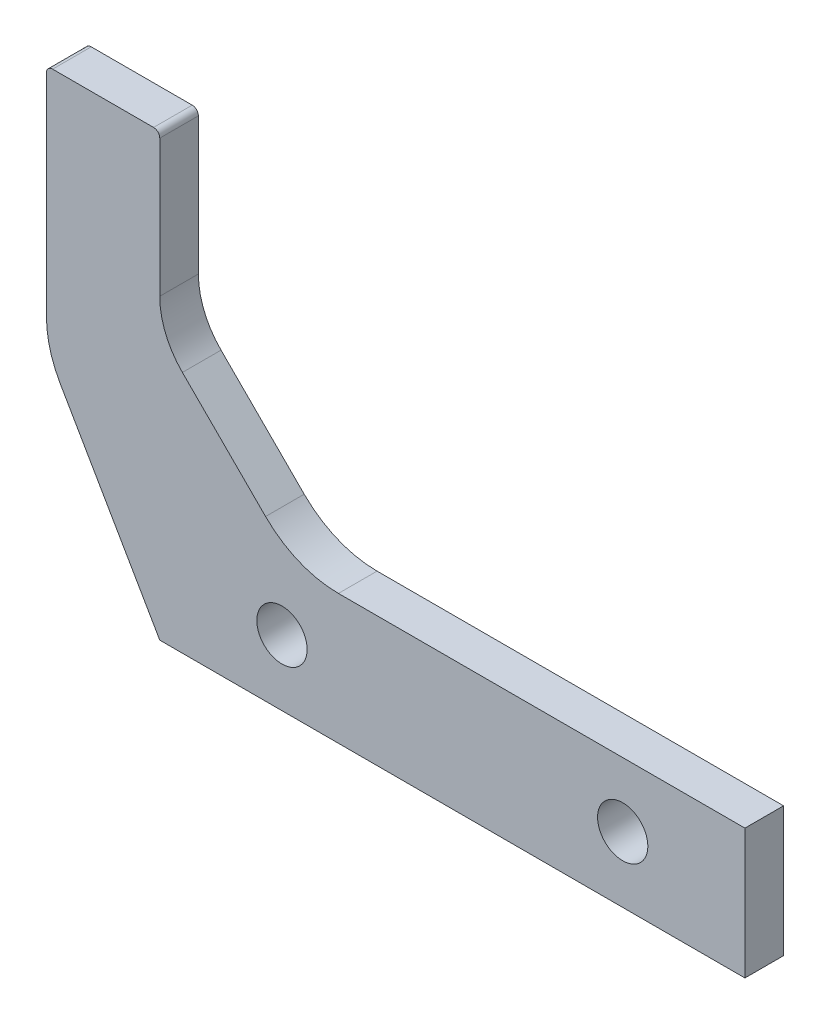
ISO-10303-21;
HEADER;
FILE_DESCRIPTION(('STEP AP214'),'2;1');
FILE_NAME('part.step','',(''),(''),'','','');
FILE_SCHEMA(('AUTOMOTIVE_DESIGN { 1 0 10303 214 1 1 1 1 }'));
ENDSEC;
DATA;
#1=APPLICATION_CONTEXT('core data for automotive mechanical design processes');
#2=APPLICATION_PROTOCOL_DEFINITION('international standard','automotive_design',2000,#1);
#3=PRODUCT_CONTEXT('',#1,'mechanical');
#4=PRODUCT('Part','Part','',(#3));
#5=PRODUCT_RELATED_PRODUCT_CATEGORY('part','',(#4));
#6=PRODUCT_DEFINITION_FORMATION('','',#4);
#7=PRODUCT_DEFINITION_CONTEXT('part definition',#1,'design');
#8=PRODUCT_DEFINITION('design','',#6,#7);
#9=PRODUCT_DEFINITION_SHAPE('','',#8);
#10=(LENGTH_UNIT() NAMED_UNIT(*) SI_UNIT(.MILLI.,.METRE.));
#11=(NAMED_UNIT(*) PLANE_ANGLE_UNIT() SI_UNIT($,.RADIAN.));
#12=(NAMED_UNIT(*) SI_UNIT($,.STERADIAN.) SOLID_ANGLE_UNIT());
#13=UNCERTAINTY_MEASURE_WITH_UNIT(LENGTH_MEASURE(1.E-05),#10,'distance_accuracy_value','');
#14=(GEOMETRIC_REPRESENTATION_CONTEXT(3) GLOBAL_UNCERTAINTY_ASSIGNED_CONTEXT((#13)) GLOBAL_UNIT_ASSIGNED_CONTEXT((#10,
#11,#12)) REPRESENTATION_CONTEXT('',''));
#15=CARTESIAN_POINT('',(0.,0.,0.));
#16=DIRECTION('',(0.,0.,1.));
#17=DIRECTION('',(1.,0.,0.));
#18=AXIS2_PLACEMENT_3D('',#15,#16,#17);
#19=CARTESIAN_POINT('',(-6.985,0.,1.190625));
#20=DIRECTION('',(1.,0.,0.));
#21=DIRECTION('',(0.,1.,0.));
#22=AXIS2_PLACEMENT_3D('',#19,#20,#21);
#23=PLANE('',#22);
#24=DIRECTION('',(0.,-1.,0.));
#25=VECTOR('',#24,1.);
#26=CARTESIAN_POINT('',(-6.985,0.,-1.19062500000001));
#27=LINE('',#26,#25);
#28=CARTESIAN_POINT('',(-6.985,-0.380999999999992,-1.19062500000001));
#29=VERTEX_POINT('',#28);
#30=CARTESIAN_POINT('',(-6.985,-13.3781477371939,-1.19062500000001));
#31=VERTEX_POINT('',#30);
#32=EDGE_CURVE('E134',#29,#31,#27,.T.);
#33=ORIENTED_EDGE('',*,*,#32,.T.);
#34=DIRECTION('',(0.,0.,-1.));
#35=VECTOR('',#34,1.);
#36=CARTESIAN_POINT('',(-6.985,-13.3781477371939,1.190625));
#37=LINE('',#36,#35);
#38=CARTESIAN_POINT('',(-6.985,-13.3781477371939,1.190625));
#39=VERTEX_POINT('',#38);
#40=EDGE_CURVE('E216',#31,#39,#37,.F.);
#41=ORIENTED_EDGE('',*,*,#40,.T.);
#42=DIRECTION('',(0.,-1.,0.));
#43=VECTOR('',#42,1.);
#44=CARTESIAN_POINT('',(-6.985,0.,1.190625));
#45=LINE('',#44,#43);
#46=CARTESIAN_POINT('',(-6.985,-0.380999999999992,1.190625));
#47=VERTEX_POINT('',#46);
#48=EDGE_CURVE('E161',#47,#39,#45,.T.);
#49=ORIENTED_EDGE('',*,*,#48,.F.);
#50=DIRECTION('',(0.,0.,-1.));
#51=VECTOR('',#50,1.);
#52=CARTESIAN_POINT('',(-6.985,-0.380999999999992,1.190625));
#53=LINE('',#52,#51);
#54=EDGE_CURVE('E195',#47,#29,#53,.T.);
#55=ORIENTED_EDGE('',*,*,#54,.T.);
#56=EDGE_LOOP('',(#33,#41,#49,#55));
#57=FACE_BOUND('',#56,.T.);
#58=ADVANCED_FACE('F30',(#57),#23,.F.);
#59=CARTESIAN_POINT('',(0.,-27.178,1.190625));
#60=DIRECTION('',(0.866025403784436,0.500000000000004,0.));
#61=DIRECTION('',(-0.500000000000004,0.866025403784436,0.));
#62=AXIS2_PLACEMENT_3D('',#59,#60,#61);
#63=PLANE('',#62);
#64=DIRECTION('',(0.500000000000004,-0.866025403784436,0.));
#65=VECTOR('',#64,1.);
#66=CARTESIAN_POINT('',(0.,-27.178,1.190625));
#67=LINE('',#66,#65);
#68=CARTESIAN_POINT('',(-6.13426131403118,-16.5531477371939,1.19062499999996));
#69=VERTEX_POINT('',#68);
#70=CARTESIAN_POINT('',(0.,-27.178,1.190625));
#71=VERTEX_POINT('',#70);
#72=EDGE_CURVE('E164',#69,#71,#67,.T.);
#73=ORIENTED_EDGE('',*,*,#72,.F.);
#74=DIRECTION('',(0.,0.,-1.));
#75=VECTOR('',#74,1.);
#76=CARTESIAN_POINT('',(-6.13426131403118,-16.5531477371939,1.19062499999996));
#77=LINE('',#76,#75);
#78=CARTESIAN_POINT('',(-6.13426131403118,-16.5531477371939,-1.190625));
#79=VERTEX_POINT('',#78);
#80=EDGE_CURVE('E130',#69,#79,#77,.T.);
#81=ORIENTED_EDGE('',*,*,#80,.T.);
#82=DIRECTION('',(0.500000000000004,-0.866025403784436,0.));
#83=VECTOR('',#82,1.);
#84=CARTESIAN_POINT('',(0.,-27.178,-1.19062500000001));
#85=LINE('',#84,#83);
#86=CARTESIAN_POINT('',(0.,-27.178,-1.19062500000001));
#87=VERTEX_POINT('',#86);
#88=EDGE_CURVE('E123',#79,#87,#85,.T.);
#89=ORIENTED_EDGE('',*,*,#88,.T.);
#90=DIRECTION('',(0.,0.,-1.));
#91=VECTOR('',#90,1.);
#92=CARTESIAN_POINT('',(0.,-27.178,1.190625));
#93=LINE('',#92,#91);
#94=EDGE_CURVE('E127',#71,#87,#93,.T.);
#95=ORIENTED_EDGE('',*,*,#94,.F.);
#96=EDGE_LOOP('',(#73,#81,#89,#95));
#97=FACE_BOUND('',#96,.T.);
#98=ADVANCED_FACE('F126',(#97),#63,.F.);
#99=CARTESIAN_POINT('',(0.,-27.178,1.190625));
#100=DIRECTION('',(0.,1.,0.));
#101=DIRECTION('',(0.,0.,1.));
#102=AXIS2_PLACEMENT_3D('',#99,#100,#101);
#103=PLANE('',#102);
#104=ORIENTED_EDGE('',*,*,#94,.T.);
#105=DIRECTION('',(1.,0.,0.));
#106=VECTOR('',#105,1.);
#107=CARTESIAN_POINT('',(0.,-27.178,-1.19062500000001));
#108=LINE('',#107,#106);
#109=CARTESIAN_POINT('',(36.068,-27.178,-1.19062500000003));
#110=VERTEX_POINT('',#109);
#111=EDGE_CURVE('E133',#87,#110,#108,.T.);
#112=ORIENTED_EDGE('',*,*,#111,.T.);
#113=DIRECTION('',(0.,0.,-1.));
#114=VECTOR('',#113,1.);
#115=CARTESIAN_POINT('',(36.068,-27.178,1.19062499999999));
#116=LINE('',#115,#114);
#117=CARTESIAN_POINT('',(36.068,-27.178,1.19062499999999));
#118=VERTEX_POINT('',#117);
#119=EDGE_CURVE('E142',#118,#110,#116,.T.);
#120=ORIENTED_EDGE('',*,*,#119,.F.);
#121=DIRECTION('',(1.,0.,0.));
#122=VECTOR('',#121,1.);
#123=CARTESIAN_POINT('',(0.,-27.178,1.190625));
#124=LINE('',#123,#122);
#125=EDGE_CURVE('E140',#71,#118,#124,.T.);
#126=ORIENTED_EDGE('',*,*,#125,.F.);
#127=EDGE_LOOP('',(#104,#112,#120,#126));
#128=FACE_BOUND('',#127,.T.);
#129=ADVANCED_FACE('F138',(#128),#103,.F.);
#130=CARTESIAN_POINT('',(36.068,-19.177,1.19062499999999));
#131=DIRECTION('',(-1.,0.,0.));
#132=DIRECTION('',(0.,0.,1.));
#133=AXIS2_PLACEMENT_3D('',#130,#131,#132);
#134=PLANE('',#133);
#135=ORIENTED_EDGE('',*,*,#119,.T.);
#136=DIRECTION('',(0.,1.,0.));
#137=VECTOR('',#136,1.);
#138=CARTESIAN_POINT('',(36.068,-19.177,-1.19062500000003));
#139=LINE('',#138,#137);
#140=CARTESIAN_POINT('',(36.068,-19.177,-1.19062500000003));
#141=VERTEX_POINT('',#140);
#142=EDGE_CURVE('E148',#110,#141,#139,.T.);
#143=ORIENTED_EDGE('',*,*,#142,.T.);
#144=DIRECTION('',(0.,0.,-1.));
#145=VECTOR('',#144,1.);
#146=CARTESIAN_POINT('',(36.068,-19.177,1.19062499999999));
#147=LINE('',#146,#145);
#148=CARTESIAN_POINT('',(36.068,-19.177,1.19062499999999));
#149=VERTEX_POINT('',#148);
#150=EDGE_CURVE('E176',#149,#141,#147,.T.);
#151=ORIENTED_EDGE('',*,*,#150,.F.);
#152=DIRECTION('',(0.,1.,0.));
#153=VECTOR('',#152,1.);
#154=CARTESIAN_POINT('',(36.068,-19.177,1.19062499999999));
#155=LINE('',#154,#153);
#156=EDGE_CURVE('E167',#118,#149,#155,.T.);
#157=ORIENTED_EDGE('',*,*,#156,.F.);
#158=EDGE_LOOP('',(#135,#143,#151,#157));
#159=FACE_BOUND('',#158,.T.);
#160=ADVANCED_FACE('F237',(#159),#134,.F.);
#161=CARTESIAN_POINT('',(0.,-19.177,1.190625));
#162=DIRECTION('',(0.,-1.,0.));
#163=DIRECTION('',(0.,0.,-1.));
#164=AXIS2_PLACEMENT_3D('',#161,#162,#163);
#165=PLANE('',#164);
#166=DIRECTION('',(-1.,0.,0.));
#167=VECTOR('',#166,1.);
#168=CARTESIAN_POINT('',(0.,-19.177,-1.19062500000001));
#169=LINE('',#168,#167);
#170=CARTESIAN_POINT('',(11.0122561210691,-19.177,-1.190625));
#171=VERTEX_POINT('',#170);
#172=EDGE_CURVE('E150',#141,#171,#169,.T.);
#173=ORIENTED_EDGE('',*,*,#172,.T.);
#174=DIRECTION('',(0.,0.,-1.));
#175=VECTOR('',#174,1.);
#176=CARTESIAN_POINT('',(11.0122561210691,-19.177,1.19062499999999));
#177=LINE('',#176,#175);
#178=CARTESIAN_POINT('',(11.0122561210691,-19.177,1.19062499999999));
#179=VERTEX_POINT('',#178);
#180=EDGE_CURVE('E220',#171,#179,#177,.F.);
#181=ORIENTED_EDGE('',*,*,#180,.T.);
#182=DIRECTION('',(-1.,0.,0.));
#183=VECTOR('',#182,1.);
#184=CARTESIAN_POINT('',(0.,-19.177,1.190625));
#185=LINE('',#184,#183);
#186=EDGE_CURVE('E169',#149,#179,#185,.T.);
#187=ORIENTED_EDGE('',*,*,#186,.F.);
#188=ORIENTED_EDGE('',*,*,#150,.T.);
#189=EDGE_LOOP('',(#173,#181,#187,#188));
#190=FACE_BOUND('',#189,.T.);
#191=ADVANCED_FACE('F232',(#190),#165,.F.);
#192=CARTESIAN_POINT('',(0.,0.,1.190625));
#193=DIRECTION('',(-1.,0.,0.));
#194=DIRECTION('',(0.,-1.,0.));
#195=AXIS2_PLACEMENT_3D('',#192,#193,#194);
#196=PLANE('',#195);
#197=DIRECTION('',(0.,1.,0.));
#198=VECTOR('',#197,1.);
#199=CARTESIAN_POINT('',(0.,0.,1.190625));
#200=LINE('',#199,#198);
#201=CARTESIAN_POINT('',(0.,-8.82230790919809,1.190625));
#202=VERTEX_POINT('',#201);
#203=CARTESIAN_POINT('',(0.,-0.380999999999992,1.190625));
#204=VERTEX_POINT('',#203);
#205=EDGE_CURVE('E171',#202,#204,#200,.T.);
#206=ORIENTED_EDGE('',*,*,#205,.F.);
#207=DIRECTION('',(0.,0.,1.));
#208=VECTOR('',#207,1.);
#209=CARTESIAN_POINT('',(0.,-8.82230790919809,-1.19062500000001));
#210=LINE('',#209,#208);
#211=CARTESIAN_POINT('',(0.,-8.82230790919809,-1.19062500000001));
#212=VERTEX_POINT('',#211);
#213=EDGE_CURVE('E203',#202,#212,#210,.F.);
#214=ORIENTED_EDGE('',*,*,#213,.T.);
#215=DIRECTION('',(0.,1.,0.));
#216=VECTOR('',#215,1.);
#217=CARTESIAN_POINT('',(0.,0.,-1.19062500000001));
#218=LINE('',#217,#216);
#219=CARTESIAN_POINT('',(0.,-0.380999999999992,-1.19062500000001));
#220=VERTEX_POINT('',#219);
#221=EDGE_CURVE('E156',#212,#220,#218,.T.);
#222=ORIENTED_EDGE('',*,*,#221,.T.);
#223=DIRECTION('',(0.,0.,-1.));
#224=VECTOR('',#223,1.);
#225=CARTESIAN_POINT('',(0.,-0.380999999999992,1.190625));
#226=LINE('',#225,#224);
#227=EDGE_CURVE('E188',#220,#204,#226,.F.);
#228=ORIENTED_EDGE('',*,*,#227,.T.);
#229=EDGE_LOOP('',(#206,#214,#222,#228));
#230=FACE_BOUND('',#229,.T.);
#231=ADVANCED_FACE('F244',(#230),#196,.F.);
#232=CARTESIAN_POINT('',(-6.985,0.,1.190625));
#233=DIRECTION('',(0.,-1.,0.));
#234=DIRECTION('',(0.,0.,-1.));
#235=AXIS2_PLACEMENT_3D('',#232,#233,#234);
#236=PLANE('',#235);
#237=DIRECTION('',(-1.,0.,0.));
#238=VECTOR('',#237,1.);
#239=CARTESIAN_POINT('',(-6.985,0.,1.190625));
#240=LINE('',#239,#238);
#241=CARTESIAN_POINT('',(-0.38100000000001,0.,1.190625));
#242=VERTEX_POINT('',#241);
#243=CARTESIAN_POINT('',(-6.604,0.,1.190625));
#244=VERTEX_POINT('',#243);
#245=EDGE_CURVE('E173',#242,#244,#240,.T.);
#246=ORIENTED_EDGE('',*,*,#245,.F.);
#247=DIRECTION('',(0.,0.,-1.));
#248=VECTOR('',#247,1.);
#249=CARTESIAN_POINT('',(-0.38100000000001,0.,1.190625));
#250=LINE('',#249,#248);
#251=CARTESIAN_POINT('',(-0.380999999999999,0.,-1.190625));
#252=VERTEX_POINT('',#251);
#253=EDGE_CURVE('E180',#242,#252,#250,.T.);
#254=ORIENTED_EDGE('',*,*,#253,.T.);
#255=DIRECTION('',(-1.,0.,0.));
#256=VECTOR('',#255,1.);
#257=CARTESIAN_POINT('',(-6.985,0.,-1.19062500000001));
#258=LINE('',#257,#256);
#259=CARTESIAN_POINT('',(-6.604,0.,-1.19062500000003));
#260=VERTEX_POINT('',#259);
#261=EDGE_CURVE('E158',#252,#260,#258,.T.);
#262=ORIENTED_EDGE('',*,*,#261,.T.);
#263=DIRECTION('',(0.,0.,-1.));
#264=VECTOR('',#263,1.);
#265=CARTESIAN_POINT('',(-6.604,0.,1.190625));
#266=LINE('',#265,#264);
#267=EDGE_CURVE('E141',#260,#244,#266,.F.);
#268=ORIENTED_EDGE('',*,*,#267,.T.);
#269=EDGE_LOOP('',(#246,#254,#262,#268));
#270=FACE_BOUND('',#269,.T.);
#271=ADVANCED_FACE('F268',(#270),#236,.F.);
#272=CARTESIAN_POINT('',(-6.985,-27.178,1.190625));
#273=DIRECTION('',(0.,0.,1.));
#274=DIRECTION('',(1.,0.,0.));
#275=AXIS2_PLACEMENT_3D('',#272,#273,#274);
#276=PLANE('',#275);
#277=CARTESIAN_POINT('',(28.53436,-23.13686,1.19062499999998));
#278=DIRECTION('',(0.,0.,1.));
#279=DIRECTION('',(1.,0.,0.));
#280=AXIS2_PLACEMENT_3D('',#277,#278,#279);
#281=CIRCLE('',#280,1.55);
#282=CARTESIAN_POINT('',(30.08436,-23.13686,1.19062499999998));
#283=VERTEX_POINT('',#282);
#284=EDGE_CURVE('E366',#283,#283,#281,.T.);
#285=ORIENTED_EDGE('',*,*,#284,.F.);
#286=EDGE_LOOP('',(#285));
#287=FACE_BOUND('',#286,.T.);
#288=CARTESIAN_POINT('',(7.53363999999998,-23.13686,1.19062499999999));
#289=DIRECTION('',(0.,0.,1.));
#290=DIRECTION('',(1.,0.,0.));
#291=AXIS2_PLACEMENT_3D('',#288,#289,#290);
#292=CIRCLE('',#291,1.55);
#293=CARTESIAN_POINT('',(9.08363999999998,-23.13686,1.19062499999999));
#294=VERTEX_POINT('',#293);
#295=EDGE_CURVE('E257',#294,#294,#292,.T.);
#296=ORIENTED_EDGE('',*,*,#295,.F.);
#297=EDGE_LOOP('',(#296));
#298=FACE_BOUND('',#297,.T.);
#299=ORIENTED_EDGE('',*,*,#48,.T.);
#300=CARTESIAN_POINT('',(-0.635000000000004,-13.3781477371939,1.19062500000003));
#301=DIRECTION('',(0.,0.,1.));
#302=DIRECTION('',(1.,0.,0.));
#303=AXIS2_PLACEMENT_3D('',#300,#301,#302);
#304=CIRCLE('',#303,6.35);
#305=EDGE_CURVE('E218',#39,#69,#304,.T.);
#306=ORIENTED_EDGE('',*,*,#305,.T.);
#307=ORIENTED_EDGE('',*,*,#72,.T.);
#308=ORIENTED_EDGE('',*,*,#125,.T.);
#309=ORIENTED_EDGE('',*,*,#156,.T.);
#310=ORIENTED_EDGE('',*,*,#186,.T.);
#311=CARTESIAN_POINT('',(11.0122561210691,-12.827,1.19062499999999));
#312=DIRECTION('',(0.,0.,1.));
#313=DIRECTION('',(1.,0.,0.));
#314=AXIS2_PLACEMENT_3D('',#311,#312,#313);
#315=CIRCLE('',#314,6.35);
#316=CARTESIAN_POINT('',(6.52212806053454,-17.3171280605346,1.190625));
#317=VERTEX_POINT('',#316);
#318=EDGE_CURVE('E37',#179,#317,#315,.F.);
#319=ORIENTED_EDGE('',*,*,#318,.T.);
#320=DIRECTION('',(0.707106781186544,-0.707106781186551,0.));
#321=VECTOR('',#320,1.);
#322=CARTESIAN_POINT('',(0.,-10.7949999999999,1.190625));
#323=LINE('',#322,#321);
#324=CARTESIAN_POINT('',(1.39490395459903,-12.189903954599,1.190625));
#325=VERTEX_POINT('',#324);
#326=EDGE_CURVE('E201',#317,#325,#323,.F.);
#327=ORIENTED_EDGE('',*,*,#326,.T.);
#328=CARTESIAN_POINT('',(4.7625,-8.82230790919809,1.190625));
#329=DIRECTION('',(0.,0.,1.));
#330=DIRECTION('',(1.,0.,0.));
#331=AXIS2_PLACEMENT_3D('',#328,#329,#330);
#332=CIRCLE('',#331,4.7625);
#333=EDGE_CURVE('E211',#325,#202,#332,.F.);
#334=ORIENTED_EDGE('',*,*,#333,.T.);
#335=ORIENTED_EDGE('',*,*,#205,.T.);
#336=CARTESIAN_POINT('',(-0.38100000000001,-0.380999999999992,1.190625));
#337=DIRECTION('',(0.,0.,1.));
#338=DIRECTION('',(1.,0.,0.));
#339=AXIS2_PLACEMENT_3D('',#336,#337,#338);
#340=CIRCLE('',#339,0.381);
#341=EDGE_CURVE('E193',#204,#242,#340,.T.);
#342=ORIENTED_EDGE('',*,*,#341,.T.);
#343=ORIENTED_EDGE('',*,*,#245,.T.);
#344=CARTESIAN_POINT('',(-6.604,-0.380999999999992,1.190625));
#345=DIRECTION('',(0.,0.,1.));
#346=DIRECTION('',(1.,0.,0.));
#347=AXIS2_PLACEMENT_3D('',#344,#345,#346);
#348=CIRCLE('',#347,0.381);
#349=EDGE_CURVE('E191',#244,#47,#348,.T.);
#350=ORIENTED_EDGE('',*,*,#349,.T.);
#351=EDGE_LOOP('',(#299,#306,#307,#308,#309,#310,#319,#327,#334,#335,#342,#343,#350));
#352=FACE_BOUND('',#351,.T.);
#353=ADVANCED_FACE('F233',(#287,#298,#352),#276,.T.);
#354=CARTESIAN_POINT('',(-6.985,-27.178,-1.19062500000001));
#355=DIRECTION('',(0.,0.,1.));
#356=DIRECTION('',(1.,0.,0.));
#357=AXIS2_PLACEMENT_3D('',#354,#355,#356);
#358=PLANE('',#357);
#359=CARTESIAN_POINT('',(28.53436,-23.13686,-1.190625));
#360=DIRECTION('',(0.,0.,1.));
#361=DIRECTION('',(1.,0.,0.));
#362=AXIS2_PLACEMENT_3D('',#359,#360,#361);
#363=CIRCLE('',#362,1.55);
#364=CARTESIAN_POINT('',(30.08436,-23.13686,-1.190625));
#365=VERTEX_POINT('',#364);
#366=EDGE_CURVE('E363',#365,#365,#363,.T.);
#367=ORIENTED_EDGE('',*,*,#366,.T.);
#368=EDGE_LOOP('',(#367));
#369=FACE_BOUND('',#368,.T.);
#370=CARTESIAN_POINT('',(7.53363999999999,-23.13686,-1.190625));
#371=DIRECTION('',(0.,0.,1.));
#372=DIRECTION('',(1.,0.,0.));
#373=AXIS2_PLACEMENT_3D('',#370,#371,#372);
#374=CIRCLE('',#373,1.55);
#375=CARTESIAN_POINT('',(9.08363999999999,-23.13686,-1.190625));
#376=VERTEX_POINT('',#375);
#377=EDGE_CURVE('E367',#376,#376,#374,.T.);
#378=ORIENTED_EDGE('',*,*,#377,.T.);
#379=EDGE_LOOP('',(#378));
#380=FACE_BOUND('',#379,.T.);
#381=ORIENTED_EDGE('',*,*,#88,.F.);
#382=CARTESIAN_POINT('',(-0.635000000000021,-13.3781477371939,-1.190625));
#383=DIRECTION('',(0.,0.,1.));
#384=DIRECTION('',(1.,0.,0.));
#385=AXIS2_PLACEMENT_3D('',#382,#383,#384);
#386=CIRCLE('',#385,6.35);
#387=EDGE_CURVE('E214',#79,#31,#386,.F.);
#388=ORIENTED_EDGE('',*,*,#387,.T.);
#389=ORIENTED_EDGE('',*,*,#32,.F.);
#390=CARTESIAN_POINT('',(-6.604,-0.380999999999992,-1.19062500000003));
#391=DIRECTION('',(0.,0.,1.));
#392=DIRECTION('',(1.,0.,0.));
#393=AXIS2_PLACEMENT_3D('',#390,#391,#392);
#394=CIRCLE('',#393,0.381);
#395=EDGE_CURVE('E183',#29,#260,#394,.F.);
#396=ORIENTED_EDGE('',*,*,#395,.T.);
#397=ORIENTED_EDGE('',*,*,#261,.F.);
#398=CARTESIAN_POINT('',(-0.380999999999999,-0.380999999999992,-1.190625));
#399=DIRECTION('',(0.,0.,1.));
#400=DIRECTION('',(1.,0.,0.));
#401=AXIS2_PLACEMENT_3D('',#398,#399,#400);
#402=CIRCLE('',#401,0.381);
#403=EDGE_CURVE('E185',#252,#220,#402,.F.);
#404=ORIENTED_EDGE('',*,*,#403,.T.);
#405=ORIENTED_EDGE('',*,*,#221,.F.);
#406=CARTESIAN_POINT('',(4.7625,-8.82230790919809,-1.190625));
#407=DIRECTION('',(0.,0.,1.));
#408=DIRECTION('',(1.,0.,0.));
#409=AXIS2_PLACEMENT_3D('',#406,#407,#408);
#410=CIRCLE('',#409,4.7625);
#411=CARTESIAN_POINT('',(1.39490395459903,-12.189903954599,-1.19062500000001));
#412=VERTEX_POINT('',#411);
#413=EDGE_CURVE('E209',#212,#412,#410,.T.);
#414=ORIENTED_EDGE('',*,*,#413,.T.);
#415=DIRECTION('',(-0.707106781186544,0.707106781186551,0.));
#416=VECTOR('',#415,1.);
#417=CARTESIAN_POINT('',(4.69900000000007,-15.4940000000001,-1.19062500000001));
#418=LINE('',#417,#416);
#419=CARTESIAN_POINT('',(6.52212806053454,-17.3171280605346,-1.190625));
#420=VERTEX_POINT('',#419);
#421=EDGE_CURVE('E198',#412,#420,#418,.F.);
#422=ORIENTED_EDGE('',*,*,#421,.T.);
#423=CARTESIAN_POINT('',(11.0122561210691,-12.827,-1.190625));
#424=DIRECTION('',(0.,0.,1.));
#425=DIRECTION('',(1.,0.,0.));
#426=AXIS2_PLACEMENT_3D('',#423,#424,#425);
#427=CIRCLE('',#426,6.35);
#428=EDGE_CURVE('E11',#420,#171,#427,.T.);
#429=ORIENTED_EDGE('',*,*,#428,.T.);
#430=ORIENTED_EDGE('',*,*,#172,.F.);
#431=ORIENTED_EDGE('',*,*,#142,.F.);
#432=ORIENTED_EDGE('',*,*,#111,.F.);
#433=EDGE_LOOP('',(#381,#388,#389,#396,#397,#404,#405,#414,#422,#429,#430,#431,#432));
#434=FACE_BOUND('',#433,.T.);
#435=ADVANCED_FACE('F145',(#369,#380,#434),#358,.F.);
#436=CARTESIAN_POINT('',(-0.38100000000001,-0.380999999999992,1.190625));
#437=DIRECTION('',(0.,0.,-1.));
#438=DIRECTION('',(-1.,0.,0.));
#439=AXIS2_PLACEMENT_3D('',#436,#437,#438);
#440=CYLINDRICAL_SURFACE('',#439,0.381);
#441=ORIENTED_EDGE('',*,*,#341,.F.);
#442=ORIENTED_EDGE('',*,*,#227,.F.);
#443=ORIENTED_EDGE('',*,*,#403,.F.);
#444=ORIENTED_EDGE('',*,*,#253,.F.);
#445=EDGE_LOOP('',(#441,#442,#443,#444));
#446=FACE_BOUND('',#445,.T.);
#447=ADVANCED_FACE('F272',(#446),#440,.T.);
#448=CARTESIAN_POINT('',(-6.604,-0.380999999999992,1.190625));
#449=DIRECTION('',(0.,0.,-1.));
#450=DIRECTION('',(-1.,0.,0.));
#451=AXIS2_PLACEMENT_3D('',#448,#449,#450);
#452=CYLINDRICAL_SURFACE('',#451,0.381);
#453=ORIENTED_EDGE('',*,*,#349,.F.);
#454=ORIENTED_EDGE('',*,*,#267,.F.);
#455=ORIENTED_EDGE('',*,*,#395,.F.);
#456=ORIENTED_EDGE('',*,*,#54,.F.);
#457=EDGE_LOOP('',(#453,#454,#455,#456));
#458=FACE_BOUND('',#457,.T.);
#459=ADVANCED_FACE('F263',(#458),#452,.T.);
#460=CARTESIAN_POINT('',(0.,-10.7949999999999,1.190625));
#461=DIRECTION('',(0.707106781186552,0.707106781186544,0.));
#462=DIRECTION('',(-0.707106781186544,0.707106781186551,0.));
#463=AXIS2_PLACEMENT_3D('',#460,#461,#462);
#464=PLANE('',#463);
#465=ORIENTED_EDGE('',*,*,#326,.F.);
#466=DIRECTION('',(0.,0.,1.));
#467=VECTOR('',#466,1.);
#468=CARTESIAN_POINT('',(6.52212806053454,-17.3171280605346,-1.190625));
#469=LINE('',#468,#467);
#470=EDGE_CURVE('E222',#317,#420,#469,.F.);
#471=ORIENTED_EDGE('',*,*,#470,.T.);
#472=ORIENTED_EDGE('',*,*,#421,.F.);
#473=DIRECTION('',(0.,0.,-1.));
#474=VECTOR('',#473,1.);
#475=CARTESIAN_POINT('',(1.39490395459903,-12.189903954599,1.190625));
#476=LINE('',#475,#474);
#477=EDGE_CURVE('E206',#412,#325,#476,.F.);
#478=ORIENTED_EDGE('',*,*,#477,.T.);
#479=EDGE_LOOP('',(#465,#471,#472,#478));
#480=FACE_BOUND('',#479,.T.);
#481=ADVANCED_FACE('F225',(#480),#464,.T.);
#482=CARTESIAN_POINT('',(4.7625,-8.82230790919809,1.190625));
#483=DIRECTION('',(0.,0.,-1.));
#484=DIRECTION('',(-1.,0.,0.));
#485=AXIS2_PLACEMENT_3D('',#482,#483,#484);
#486=CYLINDRICAL_SURFACE('',#485,4.7625);
#487=ORIENTED_EDGE('',*,*,#333,.F.);
#488=ORIENTED_EDGE('',*,*,#477,.F.);
#489=ORIENTED_EDGE('',*,*,#413,.F.);
#490=ORIENTED_EDGE('',*,*,#213,.F.);
#491=EDGE_LOOP('',(#487,#488,#489,#490));
#492=FACE_BOUND('',#491,.T.);
#493=ADVANCED_FACE('F279',(#492),#486,.F.);
#494=CARTESIAN_POINT('',(-0.635000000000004,-13.3781477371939,1.19062500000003));
#495=DIRECTION('',(0.,0.,-1.));
#496=DIRECTION('',(-1.,0.,0.));
#497=AXIS2_PLACEMENT_3D('',#494,#495,#496);
#498=CYLINDRICAL_SURFACE('',#497,6.35);
#499=ORIENTED_EDGE('',*,*,#305,.F.);
#500=ORIENTED_EDGE('',*,*,#40,.F.);
#501=ORIENTED_EDGE('',*,*,#387,.F.);
#502=ORIENTED_EDGE('',*,*,#80,.F.);
#503=EDGE_LOOP('',(#499,#500,#501,#502));
#504=FACE_BOUND('',#503,.T.);
#505=ADVANCED_FACE('F260',(#504),#498,.T.);
#506=CARTESIAN_POINT('',(11.0122561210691,-12.827,1.19062499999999));
#507=DIRECTION('',(0.,0.,1.));
#508=DIRECTION('',(1.,0.,0.));
#509=AXIS2_PLACEMENT_3D('',#506,#507,#508);
#510=CYLINDRICAL_SURFACE('',#509,6.35);
#511=ORIENTED_EDGE('',*,*,#428,.F.);
#512=ORIENTED_EDGE('',*,*,#470,.F.);
#513=ORIENTED_EDGE('',*,*,#318,.F.);
#514=ORIENTED_EDGE('',*,*,#180,.F.);
#515=EDGE_LOOP('',(#511,#512,#513,#514));
#516=FACE_BOUND('',#515,.T.);
#517=ADVANCED_FACE('F229',(#516),#510,.F.);
#518=CARTESIAN_POINT('',(7.53363999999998,-23.13686,1.19062499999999));
#519=DIRECTION('',(0.,0.,1.));
#520=DIRECTION('',(1.,0.,0.));
#521=AXIS2_PLACEMENT_3D('',#518,#519,#520);
#522=CYLINDRICAL_SURFACE('',#521,1.55);
#523=ORIENTED_EDGE('',*,*,#377,.F.);
#524=EDGE_LOOP('',(#523));
#525=FACE_BOUND('',#524,.T.);
#526=ORIENTED_EDGE('',*,*,#295,.T.);
#527=EDGE_LOOP('',(#526));
#528=FACE_BOUND('',#527,.T.);
#529=ADVANCED_FACE('F344',(#525,#528),#522,.F.);
#530=CARTESIAN_POINT('',(28.53436,-23.13686,1.19062499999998));
#531=DIRECTION('',(0.,0.,1.));
#532=DIRECTION('',(1.,0.,0.));
#533=AXIS2_PLACEMENT_3D('',#530,#531,#532);
#534=CYLINDRICAL_SURFACE('',#533,1.55);
#535=ORIENTED_EDGE('',*,*,#366,.F.);
#536=EDGE_LOOP('',(#535));
#537=FACE_BOUND('',#536,.T.);
#538=ORIENTED_EDGE('',*,*,#284,.T.);
#539=EDGE_LOOP('',(#538));
#540=FACE_BOUND('',#539,.T.);
#541=ADVANCED_FACE('F350',(#537,#540),#534,.F.);
#542=CLOSED_SHELL('',(#58,#98,#129,#160,#191,#231,#271,#353,#435,#447,#459,#481,#493,#505,#517,
#529,#541));
#543=MANIFOLD_SOLID_BREP('B2',#542);
#544=ADVANCED_BREP_SHAPE_REPRESENTATION('',(#18,#543),#14);
#545=SHAPE_DEFINITION_REPRESENTATION(#9,#544);
ENDSEC;
END-ISO-10303-21;
